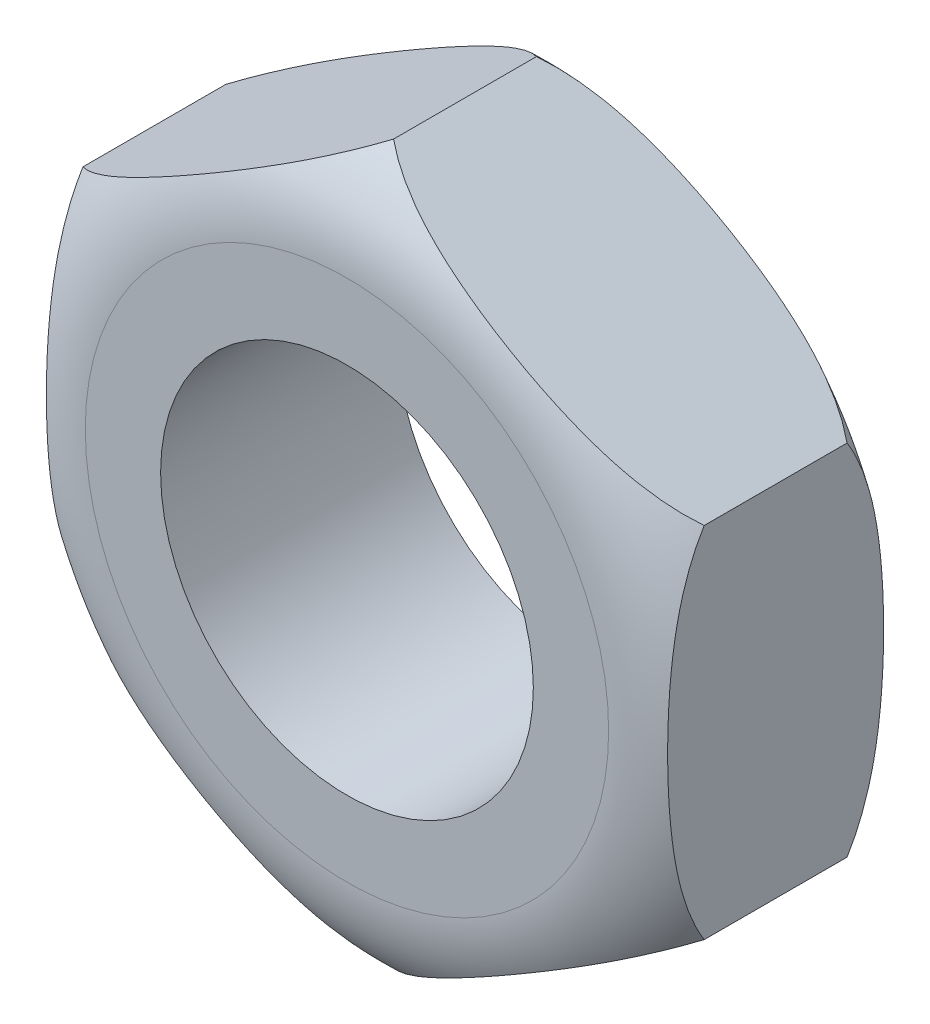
from build123d import *

# Parameters (mm, degrees)
BASE_EXTRUSION_DEPTH    = 3.8
ESQUISSE2_R             = 3
ENL_V_MAT_EXTRU_1_DEPTH = 9.530728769


with BuildPart() as part:
    # Esquisse1 → Base-Extrusion (new body)
    with BuildSketch(Plane.XY):
        Polygon((0, 5.773502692), (-5, 2.886751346), (-5, -2.886751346), (0, -5.773502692), (5, -2.886751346), (5, 2.886751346), align=None)
    extrude(amount=BASE_EXTRUSION_DEPTH)

    # Esquisse2 → Enl_v. mat.-Extru.1 (cut, through all)
    with BuildSketch(Plane.XY.offset(3.8)):
        Circle(ESQUISSE2_R)
    extrude(amount=-ENL_V_MAT_EXTRU_1_DEPTH, mode=Mode.SUBTRACT)

    # Esquisse3 → Enl_vement de mati_re-R_volution1 (revolve, cut)
    with BuildSketch(Plane(origin=(0, 0, 0), x_dir=(0, 0, -1), z_dir=(1, 0, 0)), mode=Mode.PRIVATE) as enl_vement_de_mati_re_r_volution1_sk:
        with BuildLine():
            Line((-3.8, 4.212253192), (-3.8, 5.773502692))
            Line((-3.8, 5.773502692), (-3.05, 5.773502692))
            ThreePointArc((-3.05, 5.773502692), (-3.602775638, 5.078278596), (-3.8, 4.212253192))
        make_face()
        with BuildLine():
            Line((0, 4.212253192), (0, 5.773502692))
            Line((0, 5.773502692), (-0.75, 5.773502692))
            ThreePointArc((-0.75, 5.773502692), (-0.197224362, 5.078278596), (0, 4.212253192))
        make_face()
    revolve(enl_vement_de_mati_re_r_volution1_sk.sketch.rotate(Axis((0, 0, 0), (0, 0, 1)), 90), axis=Axis((0, 0, 0), (0, 0, 1)), mode=Mode.SUBTRACT)


solid = part.part
